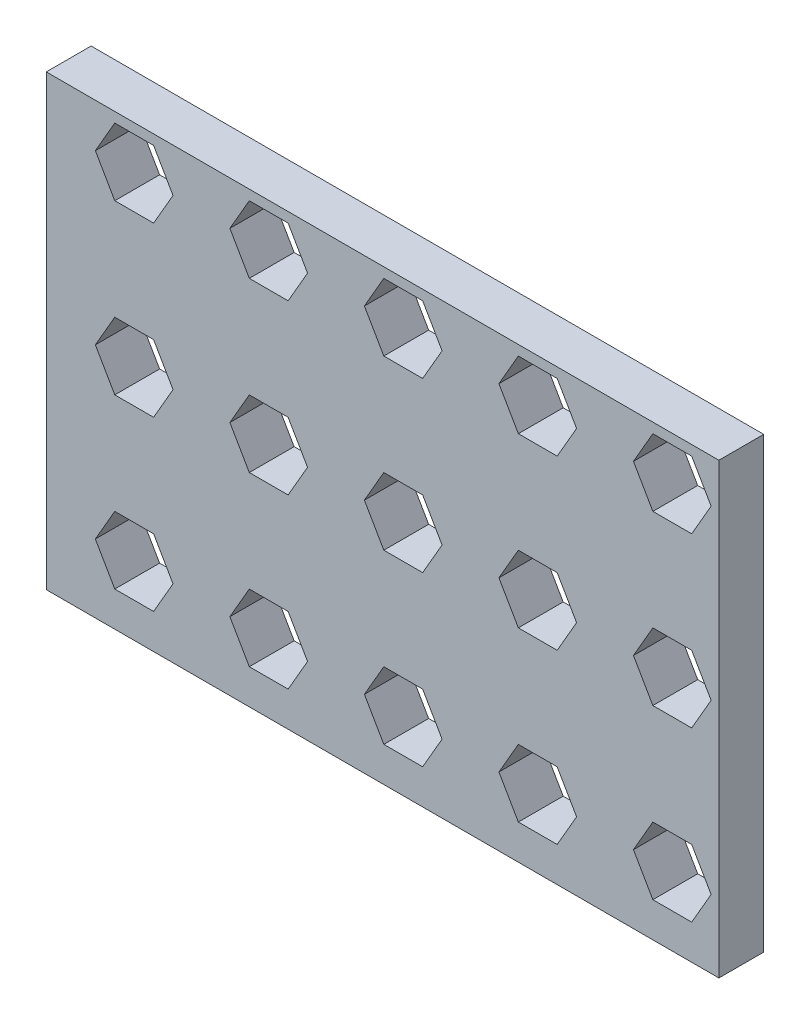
from build123d import *

# Parameters (mm, degrees)
SKETCH_1_W                  = 60
SKETCH_1_H                  = 40
EXTRUDE_1_DEPTH             = 4
CUT_EXTRUDE_1_DEPTH         = 73.221880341
PATTERN_LINEAR_1_COUNT      = 5
PATTERN_LINEAR_1_PITCH      = 12
PATTERN_LINEAR_1_COUNT_DIR2 = 3
PATTERN_LINEAR_1_PITCH_DIR2 = 15


with BuildPart() as part:
    # Sketch 1 → Extrude 1 (new body)
    with BuildSketch(Plane.XY):
        with Locations((30, 20)):
            Rectangle(SKETCH_1_W, SKETCH_1_H)
    extrude(amount=EXTRUDE_1_DEPTH)

    # Sketch 2 → Cut-Extrude 1 (cut, through all)
    with BuildSketch(Plane.XY.offset(4)):
        Polygon((11.306778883, 6.10418082), (9.574728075, 9.10418082), (6.11062646, 9.10418082), (4.378575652, 6.10418082), (6.11062646, 3.10418082), (9.574728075, 3.10418082), align=None)
    cut_extrude_1 = extrude(amount=-CUT_EXTRUDE_1_DEPTH, mode=Mode.SUBTRACT)

    # Pattern Linear 1: Cut-Extrude 1 5 × 3
    with Locations(*[(i * PATTERN_LINEAR_1_PITCH, j * PATTERN_LINEAR_1_PITCH_DIR2, 0) for i in range(PATTERN_LINEAR_1_COUNT) for j in range(PATTERN_LINEAR_1_COUNT_DIR2) if (i, j) != (0, 0)]):
        add(cut_extrude_1, mode=Mode.SUBTRACT)


solid = part.part
